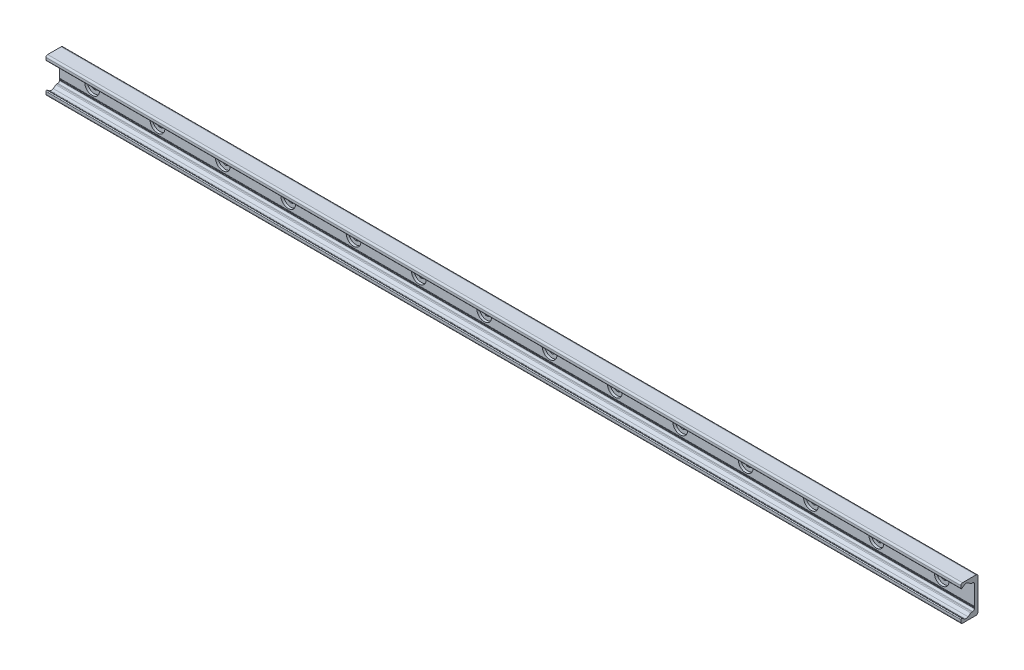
from build123d import *

# Parameters (mm, degrees)
BOSS_EXTRUDE1_DEPTH = 560
SKETCH2_R           = 9
SKETCH2_R_2         = 4.5
CUT_EXTRUDE1_DEPTH  = 3.1
SKETCH2_2_R         = 4.5
CUT_EXTRUDE2_DEPTH  = 561.655420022
LPATTERN1_COUNT     = 14
LPATTERN1_PITCH     = 80


with BuildPart() as part:
    # Sketch1 → Boss-Extrude1 (new, symmetric)
    with BuildSketch(Plane(origin=(0, 0, 0), x_dir=(0, 0, -1), z_dir=(1, 0, 0))):
        with BuildLine():
            Line((0, 0), (0, 19))
            ThreePointArc((0, 19), (-0.732233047, 20.767766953), (-2.5, 21.5))
            Line((-2.5, 21.5), (-19, 21.5))
            ThreePointArc((-19, 21.5), (-20.414213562, 20.914213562), (-21, 19.5))
            Line((-21, 19.5), (-21, 16.625057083))
            ThreePointArc((-21, 16.625057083), (-20.553251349, 15.888838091), (-19.693931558, 15.945160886))
            Line((-19.693931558, 15.945160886), (-16.794305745, 17.975500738))
            ThreePointArc((-16.794305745, 17.975500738), (-14.5, 18.69889256), (-12.205694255, 17.975500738))
            Line((-12.205694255, 17.975500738), (-8.829831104, 15.611695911))
            ThreePointArc((-8.829831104, 15.611695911), (-8.28408983, 15.342566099), (-7.682678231, 15.25))
            Line((-7.682678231, 15.25), (-6.5, 15.25))
            ThreePointArc((-6.5, 15.25), (-5.085786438, 14.664213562), (-4.5, 13.25))
            Line((-4.5, 13.25), (-4.5, -10.75))
            ThreePointArc((-4.5, -10.75), (-4.25, -11), (-4.5, -11.25))
            Line((-4.5, -11.25), (-4.5, -12.25))
            ThreePointArc((-4.5, -12.25), (-4.25, -12.5), (-4.5, -12.75))
            Line((-4.5, -12.75), (-4.5, -13.25))
            ThreePointArc((-4.5, -13.25), (-5.085786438, -14.664213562), (-6.5, -15.25))
            Line((-6.5, -15.25), (-7.682678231, -15.25))
            ThreePointArc((-7.682678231, -15.25), (-8.28408983, -15.342566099), (-8.829831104, -15.611695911))
            Line((-8.829831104, -15.611695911), (-12.205694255, -17.975500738))
            ThreePointArc((-12.205694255, -17.975500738), (-14.5, -18.69889256), (-16.794305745, -17.975500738))
            Line((-16.794305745, -17.975500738), (-19.693931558, -15.945160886))
            ThreePointArc((-19.693931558, -15.945160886), (-20.553251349, -15.888838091), (-21, -16.625057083))
            Line((-21, -16.625057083), (-21, -19.5))
            ThreePointArc((-21, -19.5), (-20.414213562, -20.914213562), (-19, -21.5))
            Line((-19, -21.5), (-2.5, -21.5))
            ThreePointArc((-2.5, -21.5), (-0.732233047, -20.767766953), (0, -19))
            Line((0, -19), (0, 0))
        make_face()
    extrude(amount=BOSS_EXTRUDE1_DEPTH, both=True)

    # Sketch2 → Cut-Extrude1 (cut)
    with BuildSketch(Plane.XY.offset(4.5)):
        with Locations((520, 0)):
            Circle(SKETCH2_R)
        with Locations((520, 0)):
            Circle(SKETCH2_R_2, mode=Mode.SUBTRACT)
    cut_extrude1 = extrude(amount=-CUT_EXTRUDE1_DEPTH, mode=Mode.SUBTRACT)

    # Sketch2_2 → Cut-Extrude2 (cut, through all)
    with BuildSketch(Plane.XY.offset(4.5)):
        with Locations((520, 0)):
            Circle(SKETCH2_2_R)
    cut_extrude2 = extrude(amount=-CUT_EXTRUDE2_DEPTH, mode=Mode.SUBTRACT)

    # LPattern1: Cut-Extrude1, Cut-Extrude2 ×14
    with Locations(*[(-i * LPATTERN1_PITCH, 0, 0) for i in range(1, LPATTERN1_COUNT)]):
        add(cut_extrude1, mode=Mode.SUBTRACT)
        add(cut_extrude2, mode=Mode.SUBTRACT)


solid = part.part
